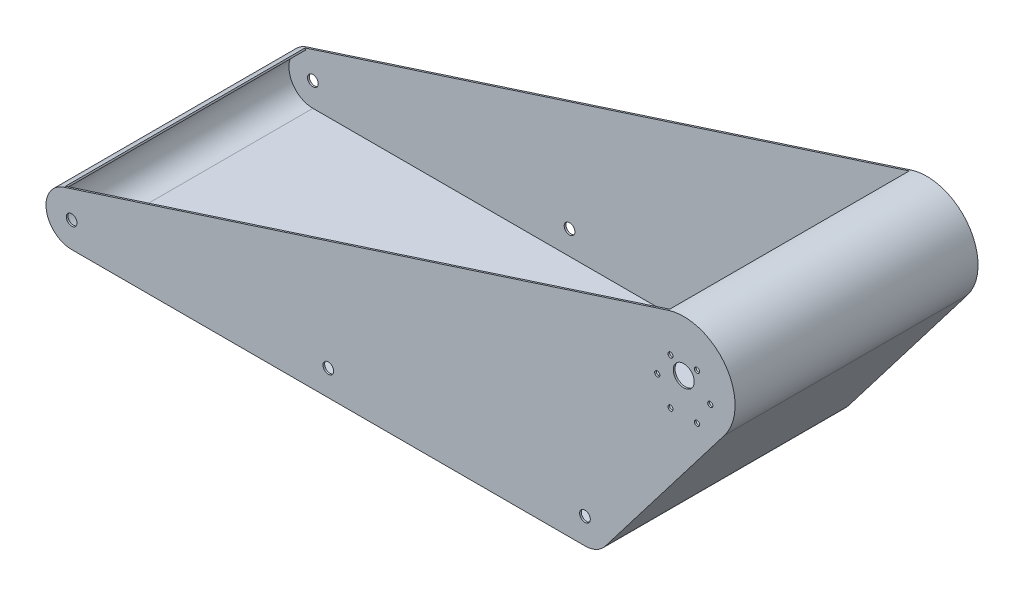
ISO-10303-21;
HEADER;
FILE_DESCRIPTION(('STEP AP214'),'2;1');
FILE_NAME('part.step','',(''),(''),'','','');
FILE_SCHEMA(('AUTOMOTIVE_DESIGN { 1 0 10303 214 1 1 1 1 }'));
ENDSEC;
DATA;
#1=APPLICATION_CONTEXT('core data for automotive mechanical design processes');
#2=APPLICATION_PROTOCOL_DEFINITION('international standard','automotive_design',2000,#1);
#3=PRODUCT_CONTEXT('',#1,'mechanical');
#4=PRODUCT('Part','Part','',(#3));
#5=PRODUCT_RELATED_PRODUCT_CATEGORY('part','',(#4));
#6=PRODUCT_DEFINITION_FORMATION('','',#4);
#7=PRODUCT_DEFINITION_CONTEXT('part definition',#1,'design');
#8=PRODUCT_DEFINITION('design','',#6,#7);
#9=PRODUCT_DEFINITION_SHAPE('','',#8);
#10=(LENGTH_UNIT() NAMED_UNIT(*) SI_UNIT(.MILLI.,.METRE.));
#11=(NAMED_UNIT(*) PLANE_ANGLE_UNIT() SI_UNIT($,.RADIAN.));
#12=(NAMED_UNIT(*) SI_UNIT($,.STERADIAN.) SOLID_ANGLE_UNIT());
#13=UNCERTAINTY_MEASURE_WITH_UNIT(LENGTH_MEASURE(1.E-05),#10,'distance_accuracy_value','');
#14=(GEOMETRIC_REPRESENTATION_CONTEXT(3) GLOBAL_UNCERTAINTY_ASSIGNED_CONTEXT((#13)) GLOBAL_UNIT_ASSIGNED_CONTEXT((#10,
#11,#12)) REPRESENTATION_CONTEXT('',''));
#15=CARTESIAN_POINT('',(0.,0.,0.));
#16=DIRECTION('',(0.,0.,1.));
#17=DIRECTION('',(1.,0.,0.));
#18=AXIS2_PLACEMENT_3D('',#15,#16,#17);
#19=CARTESIAN_POINT('',(0.,0.,1.));
#20=DIRECTION('',(0.,0.,-1.));
#21=DIRECTION('',(-1.,0.,0.));
#22=AXIS2_PLACEMENT_3D('',#19,#20,#21);
#23=CYLINDRICAL_SURFACE('',#22,15.);
#24=CARTESIAN_POINT('',(0.,0.,0.));
#25=DIRECTION('',(0.,0.,1.));
#26=DIRECTION('',(1.,0.,0.));
#27=AXIS2_PLACEMENT_3D('',#24,#25,#26);
#28=CIRCLE('',#27,15.);
#29=CARTESIAN_POINT('',(-4.61908911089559,14.2710902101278,0.));
#30=VERTEX_POINT('',#29);
#31=CARTESIAN_POINT('',(0.,-15.,0.));
#32=VERTEX_POINT('',#31);
#33=EDGE_CURVE('E232',#30,#32,#28,.T.);
#34=ORIENTED_EDGE('',*,*,#33,.T.);
#35=DIRECTION('',(0.,0.,-1.));
#36=VECTOR('',#35,1.);
#37=CARTESIAN_POINT('',(0.,-15.,1.));
#38=LINE('',#37,#36);
#39=CARTESIAN_POINT('',(0.,-15.,142.));
#40=VERTEX_POINT('',#39);
#41=EDGE_CURVE('E11',#40,#32,#38,.T.);
#42=ORIENTED_EDGE('',*,*,#41,.F.);
#43=CARTESIAN_POINT('',(0.,0.,142.));
#44=DIRECTION('',(0.,0.,1.));
#45=DIRECTION('',(1.,0.,0.));
#46=AXIS2_PLACEMENT_3D('',#43,#44,#45);
#47=CIRCLE('',#46,15.);
#48=CARTESIAN_POINT('',(-4.61908911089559,14.2710902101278,142.));
#49=VERTEX_POINT('',#48);
#50=EDGE_CURVE('E151',#49,#40,#47,.T.);
#51=ORIENTED_EDGE('',*,*,#50,.F.);
#52=DIRECTION('',(0.,0.,-1.));
#53=VECTOR('',#52,1.);
#54=CARTESIAN_POINT('',(-4.61908911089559,14.2710902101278,142.));
#55=LINE('',#54,#53);
#56=CARTESIAN_POINT('',(-4.61908911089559,14.2710902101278,141.));
#57=VERTEX_POINT('',#56);
#58=EDGE_CURVE('E147',#49,#57,#55,.T.);
#59=ORIENTED_EDGE('',*,*,#58,.T.);
#60=DIRECTION('',(0.,0.,-1.));
#61=VECTOR('',#60,1.);
#62=CARTESIAN_POINT('',(-4.61908911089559,14.2710902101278,141.));
#63=LINE('',#62,#61);
#64=CARTESIAN_POINT('',(-4.61908911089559,14.2710902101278,1.));
#65=VERTEX_POINT('',#64);
#66=EDGE_CURVE('E197',#57,#65,#63,.T.);
#67=ORIENTED_EDGE('',*,*,#66,.T.);
#68=DIRECTION('',(0.,0.,-1.));
#69=VECTOR('',#68,1.);
#70=CARTESIAN_POINT('',(-4.61908911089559,14.2710902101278,1.));
#71=LINE('',#70,#69);
#72=EDGE_CURVE('E235',#65,#30,#71,.T.);
#73=ORIENTED_EDGE('',*,*,#72,.T.);
#74=EDGE_LOOP('',(#34,#42,#51,#59,#67,#73));
#75=FACE_BOUND('',#74,.T.);
#76=ADVANCED_FACE('F42',(#75),#23,.T.);
#77=CARTESIAN_POINT('',(0.,-15.,1.));
#78=DIRECTION('',(0.,1.,0.));
#79=DIRECTION('',(0.,0.,1.));
#80=AXIS2_PLACEMENT_3D('',#77,#78,#79);
#81=PLANE('',#80);
#82=DIRECTION('',(1.,0.,0.));
#83=VECTOR('',#82,1.);
#84=CARTESIAN_POINT('',(0.,-15.,0.));
#85=LINE('',#84,#83);
#86=CARTESIAN_POINT('',(300.,-15.,0.));
#87=VERTEX_POINT('',#86);
#88=EDGE_CURVE('E239',#32,#87,#85,.T.);
#89=ORIENTED_EDGE('',*,*,#88,.T.);
#90=DIRECTION('',(0.,0.,-1.));
#91=VECTOR('',#90,1.);
#92=CARTESIAN_POINT('',(300.,-15.,1.));
#93=LINE('',#92,#91);
#94=CARTESIAN_POINT('',(300.,-15.,142.));
#95=VERTEX_POINT('',#94);
#96=EDGE_CURVE('E49',#95,#87,#93,.T.);
#97=ORIENTED_EDGE('',*,*,#96,.F.);
#98=DIRECTION('',(1.,0.,0.));
#99=VECTOR('',#98,1.);
#100=CARTESIAN_POINT('',(0.,-15.,142.));
#101=LINE('',#100,#99);
#102=EDGE_CURVE('E310',#40,#95,#101,.T.);
#103=ORIENTED_EDGE('',*,*,#102,.F.);
#104=ORIENTED_EDGE('',*,*,#41,.T.);
#105=EDGE_LOOP('',(#89,#97,#103,#104));
#106=FACE_BOUND('',#105,.T.);
#107=ADVANCED_FACE('F473',(#106),#81,.F.);
#108=CARTESIAN_POINT('',(300.,0.,1.));
#109=DIRECTION('',(0.,0.,-1.));
#110=DIRECTION('',(-1.,0.,0.));
#111=AXIS2_PLACEMENT_3D('',#108,#109,#110);
#112=CYLINDRICAL_SURFACE('',#111,15.);
#113=CARTESIAN_POINT('',(300.,0.,0.));
#114=DIRECTION('',(0.,0.,1.));
#115=DIRECTION('',(1.,0.,0.));
#116=AXIS2_PLACEMENT_3D('',#113,#114,#115);
#117=CIRCLE('',#116,15.);
#118=CARTESIAN_POINT('',(311.906339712,-9.12354507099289,0.));
#119=VERTEX_POINT('',#118);
#120=EDGE_CURVE('E241',#87,#119,#117,.T.);
#121=ORIENTED_EDGE('',*,*,#120,.T.);
#122=DIRECTION('',(0.,0.,-1.));
#123=VECTOR('',#122,1.);
#124=CARTESIAN_POINT('',(311.906339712,-9.12354507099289,1.));
#125=LINE('',#124,#123);
#126=CARTESIAN_POINT('',(311.906339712,-9.12354507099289,142.));
#127=VERTEX_POINT('',#126);
#128=EDGE_CURVE('E255',#127,#119,#125,.T.);
#129=ORIENTED_EDGE('',*,*,#128,.F.);
#130=CARTESIAN_POINT('',(300.,0.,142.));
#131=DIRECTION('',(0.,0.,1.));
#132=DIRECTION('',(1.,0.,0.));
#133=AXIS2_PLACEMENT_3D('',#130,#131,#132);
#134=CIRCLE('',#133,15.);
#135=EDGE_CURVE('E262',#95,#127,#134,.T.);
#136=ORIENTED_EDGE('',*,*,#135,.F.);
#137=ORIENTED_EDGE('',*,*,#96,.T.);
#138=EDGE_LOOP('',(#121,#129,#136,#137));
#139=FACE_BOUND('',#138,.T.);
#140=ADVANCED_FACE('F261',(#139),#112,.T.);
#141=CARTESIAN_POINT('',(311.906339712,-9.12354507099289,1.));
#142=DIRECTION('',(-0.793755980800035,0.608236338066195,0.));
#143=DIRECTION('',(-0.608236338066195,-0.793755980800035,0.));
#144=AXIS2_PLACEMENT_3D('',#141,#142,#143);
#145=PLANE('',#144);
#146=DIRECTION('',(0.608236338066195,0.793755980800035,0.));
#147=VECTOR('',#146,1.);
#148=CARTESIAN_POINT('',(311.906339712,-9.12354507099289,0.));
#149=LINE('',#148,#147);
#150=CARTESIAN_POINT('',(381.562679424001,81.778843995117,0.));
#151=VERTEX_POINT('',#150);
#152=EDGE_CURVE('E243',#119,#151,#149,.T.);
#153=ORIENTED_EDGE('',*,*,#152,.T.);
#154=DIRECTION('',(0.,0.,-1.));
#155=VECTOR('',#154,1.);
#156=CARTESIAN_POINT('',(381.562679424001,81.778843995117,1.));
#157=LINE('',#156,#155);
#158=CARTESIAN_POINT('',(381.562679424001,81.778843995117,142.));
#159=VERTEX_POINT('',#158);
#160=EDGE_CURVE('E253',#159,#151,#157,.T.);
#161=ORIENTED_EDGE('',*,*,#160,.F.);
#162=DIRECTION('',(0.608236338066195,0.793755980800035,0.));
#163=VECTOR('',#162,1.);
#164=CARTESIAN_POINT('',(311.906339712,-9.12354507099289,142.));
#165=LINE('',#164,#163);
#166=EDGE_CURVE('E159',#127,#159,#165,.T.);
#167=ORIENTED_EDGE('',*,*,#166,.F.);
#168=ORIENTED_EDGE('',*,*,#128,.T.);
#169=EDGE_LOOP('',(#153,#161,#167,#168));
#170=FACE_BOUND('',#169,.T.);
#171=ADVANCED_FACE('F273',(#170),#145,.F.);
#172=CARTESIAN_POINT('',(357.75,100.025934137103,1.));
#173=DIRECTION('',(0.,0.,-1.));
#174=DIRECTION('',(-1.,0.,0.));
#175=AXIS2_PLACEMENT_3D('',#172,#173,#174);
#176=CYLINDRICAL_SURFACE('',#175,30.);
#177=CARTESIAN_POINT('',(357.75,100.025934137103,0.));
#178=DIRECTION('',(0.,0.,1.));
#179=DIRECTION('',(1.,0.,0.));
#180=AXIS2_PLACEMENT_3D('',#177,#178,#179);
#181=CIRCLE('',#180,30.);
#182=CARTESIAN_POINT('',(348.511821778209,128.568114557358,0.));
#183=VERTEX_POINT('',#182);
#184=EDGE_CURVE('E245',#151,#183,#181,.T.);
#185=ORIENTED_EDGE('',*,*,#184,.T.);
#186=DIRECTION('',(0.,0.,-1.));
#187=VECTOR('',#186,1.);
#188=CARTESIAN_POINT('',(348.511821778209,128.568114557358,1.));
#189=LINE('',#188,#187);
#190=CARTESIAN_POINT('',(348.511821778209,128.568114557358,1.));
#191=VERTEX_POINT('',#190);
#192=EDGE_CURVE('E250',#191,#183,#189,.T.);
#193=ORIENTED_EDGE('',*,*,#192,.F.);
#194=DIRECTION('',(0.,0.,-1.));
#195=VECTOR('',#194,1.);
#196=CARTESIAN_POINT('',(348.511821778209,128.568114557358,141.));
#197=LINE('',#196,#195);
#198=CARTESIAN_POINT('',(348.511821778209,128.568114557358,141.));
#199=VERTEX_POINT('',#198);
#200=EDGE_CURVE('E167',#199,#191,#197,.T.);
#201=ORIENTED_EDGE('',*,*,#200,.F.);
#202=DIRECTION('',(0.,0.,-1.));
#203=VECTOR('',#202,1.);
#204=CARTESIAN_POINT('',(348.511821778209,128.568114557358,142.));
#205=LINE('',#204,#203);
#206=CARTESIAN_POINT('',(348.511821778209,128.568114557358,142.));
#207=VERTEX_POINT('',#206);
#208=EDGE_CURVE('E145',#207,#199,#205,.T.);
#209=ORIENTED_EDGE('',*,*,#208,.F.);
#210=CARTESIAN_POINT('',(357.75,100.025934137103,142.));
#211=DIRECTION('',(0.,0.,1.));
#212=DIRECTION('',(1.,0.,0.));
#213=AXIS2_PLACEMENT_3D('',#210,#211,#212);
#214=CIRCLE('',#213,30.);
#215=EDGE_CURVE('E152',#159,#207,#214,.T.);
#216=ORIENTED_EDGE('',*,*,#215,.F.);
#217=ORIENTED_EDGE('',*,*,#160,.T.);
#218=EDGE_LOOP('',(#185,#193,#201,#209,#216,#217));
#219=FACE_BOUND('',#218,.T.);
#220=ADVANCED_FACE('F164',(#219),#176,.T.);
#221=CARTESIAN_POINT('',(348.511821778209,128.568114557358,1.));
#222=DIRECTION('',(0.307939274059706,-0.951406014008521,0.));
#223=DIRECTION('',(0.951406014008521,0.307939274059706,0.));
#224=AXIS2_PLACEMENT_3D('',#221,#222,#223);
#225=PLANE('',#224);
#226=DIRECTION('',(-0.951406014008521,-0.307939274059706,0.));
#227=VECTOR('',#226,1.);
#228=CARTESIAN_POINT('',(348.511821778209,128.568114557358,0.));
#229=LINE('',#228,#227);
#230=EDGE_CURVE('E236',#183,#30,#229,.T.);
#231=ORIENTED_EDGE('',*,*,#230,.T.);
#232=ORIENTED_EDGE('',*,*,#72,.F.);
#233=DIRECTION('',(-0.951406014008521,-0.307939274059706,0.));
#234=VECTOR('',#233,1.);
#235=CARTESIAN_POINT('',(348.511821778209,128.568114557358,1.));
#236=LINE('',#235,#234);
#237=EDGE_CURVE('E233',#191,#65,#236,.T.);
#238=ORIENTED_EDGE('',*,*,#237,.F.);
#239=ORIENTED_EDGE('',*,*,#192,.T.);
#240=EDGE_LOOP('',(#231,#232,#238,#239));
#241=FACE_BOUND('',#240,.T.);
#242=ADVANCED_FACE('F276',(#241),#225,.F.);
#243=CARTESIAN_POINT('',(0.,0.,1.));
#244=DIRECTION('',(0.,0.,1.));
#245=DIRECTION('',(1.,0.,0.));
#246=AXIS2_PLACEMENT_3D('',#243,#244,#245);
#247=PLANE('',#246);
#248=CARTESIAN_POINT('',(0.,0.,1.));
#249=DIRECTION('',(0.,0.,1.));
#250=DIRECTION('',(1.,0.,0.));
#251=AXIS2_PLACEMENT_3D('',#248,#249,#250);
#252=CIRCLE('',#251,3.125);
#253=CARTESIAN_POINT('',(3.125,0.,1.));
#254=VERTEX_POINT('',#253);
#255=EDGE_CURVE('E303',#254,#254,#252,.T.);
#256=ORIENTED_EDGE('',*,*,#255,.F.);
#257=EDGE_LOOP('',(#256));
#258=FACE_BOUND('',#257,.T.);
#259=CARTESIAN_POINT('',(350.,106.666802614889,1.));
#260=DIRECTION('',(0.,0.,1.));
#261=DIRECTION('',(1.,0.,0.));
#262=AXIS2_PLACEMENT_3D('',#259,#260,#261);
#263=CIRCLE('',#262,1.50000000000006);
#264=CARTESIAN_POINT('',(351.5,106.666802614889,1.));
#265=VERTEX_POINT('',#264);
#266=EDGE_CURVE('E315',#265,#265,#263,.T.);
#267=ORIENTED_EDGE('',*,*,#266,.F.);
#268=EDGE_LOOP('',(#267));
#269=FACE_BOUND('',#268,.T.);
#270=CARTESIAN_POINT('',(365.5,106.666802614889,1.));
#271=DIRECTION('',(0.,0.,1.));
#272=DIRECTION('',(1.,0.,0.));
#273=AXIS2_PLACEMENT_3D('',#270,#271,#272);
#274=CIRCLE('',#273,1.5);
#275=CARTESIAN_POINT('',(367.,106.666802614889,1.));
#276=VERTEX_POINT('',#275);
#277=EDGE_CURVE('E321',#276,#276,#274,.T.);
#278=ORIENTED_EDGE('',*,*,#277,.F.);
#279=EDGE_LOOP('',(#278));
#280=FACE_BOUND('',#279,.T.);
#281=CARTESIAN_POINT('',(150.,0.,1.));
#282=DIRECTION('',(0.,0.,1.));
#283=DIRECTION('',(1.,0.,0.));
#284=AXIS2_PLACEMENT_3D('',#281,#282,#283);
#285=CIRCLE('',#284,3.125);
#286=CARTESIAN_POINT('',(153.125,0.,1.));
#287=VERTEX_POINT('',#286);
#288=EDGE_CURVE('E327',#287,#287,#285,.T.);
#289=ORIENTED_EDGE('',*,*,#288,.F.);
#290=EDGE_LOOP('',(#289));
#291=FACE_BOUND('',#290,.T.);
#292=CARTESIAN_POINT('',(357.75,100.025934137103,1.));
#293=DIRECTION('',(0.,0.,1.));
#294=DIRECTION('',(1.,0.,0.));
#295=AXIS2_PLACEMENT_3D('',#292,#293,#294);
#296=CIRCLE('',#295,6.12499999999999);
#297=CARTESIAN_POINT('',(363.875,100.025934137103,1.));
#298=VERTEX_POINT('',#297);
#299=EDGE_CURVE('E333',#298,#298,#296,.T.);
#300=ORIENTED_EDGE('',*,*,#299,.F.);
#301=EDGE_LOOP('',(#300));
#302=FACE_BOUND('',#301,.T.);
#303=CARTESIAN_POINT('',(300.,0.,1.));
#304=DIRECTION('',(0.,0.,1.));
#305=DIRECTION('',(1.,0.,0.));
#306=AXIS2_PLACEMENT_3D('',#303,#304,#305);
#307=CIRCLE('',#306,3.125);
#308=CARTESIAN_POINT('',(303.125,0.,1.));
#309=VERTEX_POINT('',#308);
#310=EDGE_CURVE('E339',#309,#309,#307,.T.);
#311=ORIENTED_EDGE('',*,*,#310,.F.);
#312=EDGE_LOOP('',(#311));
#313=FACE_BOUND('',#312,.T.);
#314=CARTESIAN_POINT('',(373.25,93.2434088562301,1.));
#315=DIRECTION('',(0.,0.,1.));
#316=DIRECTION('',(1.,0.,0.));
#317=AXIS2_PLACEMENT_3D('',#314,#315,#316);
#318=CIRCLE('',#317,1.5);
#319=CARTESIAN_POINT('',(374.75,93.2434088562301,1.));
#320=VERTEX_POINT('',#319);
#321=EDGE_CURVE('E345',#320,#320,#318,.T.);
#322=ORIENTED_EDGE('',*,*,#321,.F.);
#323=EDGE_LOOP('',(#322));
#324=FACE_BOUND('',#323,.T.);
#325=CARTESIAN_POINT('',(365.5,79.8200150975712,1.));
#326=DIRECTION('',(0.,0.,1.));
#327=DIRECTION('',(1.,0.,0.));
#328=AXIS2_PLACEMENT_3D('',#325,#326,#327);
#329=CIRCLE('',#328,1.5);
#330=CARTESIAN_POINT('',(367.,79.8200150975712,1.));
#331=VERTEX_POINT('',#330);
#332=EDGE_CURVE('E351',#331,#331,#329,.T.);
#333=ORIENTED_EDGE('',*,*,#332,.F.);
#334=EDGE_LOOP('',(#333));
#335=FACE_BOUND('',#334,.T.);
#336=CARTESIAN_POINT('',(350.,79.8200150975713,1.));
#337=DIRECTION('',(0.,0.,1.));
#338=DIRECTION('',(1.,0.,0.));
#339=AXIS2_PLACEMENT_3D('',#336,#337,#338);
#340=CIRCLE('',#339,1.5);
#341=CARTESIAN_POINT('',(351.5,79.8200150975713,1.));
#342=VERTEX_POINT('',#341);
#343=EDGE_CURVE('E357',#342,#342,#340,.T.);
#344=ORIENTED_EDGE('',*,*,#343,.F.);
#345=EDGE_LOOP('',(#344));
#346=FACE_BOUND('',#345,.T.);
#347=CARTESIAN_POINT('',(342.25,93.2434088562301,1.));
#348=DIRECTION('',(0.,0.,1.));
#349=DIRECTION('',(1.,0.,0.));
#350=AXIS2_PLACEMENT_3D('',#347,#348,#349);
#351=CIRCLE('',#350,1.5);
#352=CARTESIAN_POINT('',(343.75,93.2434088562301,1.));
#353=VERTEX_POINT('',#352);
#354=EDGE_CURVE('E363',#353,#353,#351,.T.);
#355=ORIENTED_EDGE('',*,*,#354,.F.);
#356=EDGE_LOOP('',(#355));
#357=FACE_BOUND('',#356,.T.);
#358=DIRECTION('',(-0.307939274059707,0.95140601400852,0.));
#359=VECTOR('',#358,1.);
#360=CARTESIAN_POINT('',(-4.61908911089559,14.2710902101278,1.));
#361=LINE('',#360,#359);
#362=CARTESIAN_POINT('',(-4.31114983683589,13.3196841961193,1.));
#363=VERTEX_POINT('',#362);
#364=EDGE_CURVE('E56',#363,#65,#361,.T.);
#365=ORIENTED_EDGE('',*,*,#364,.F.);
#366=CARTESIAN_POINT('',(0.,0.,1.));
#367=DIRECTION('',(0.,0.,-1.));
#368=DIRECTION('',(1.,0.,0.));
#369=AXIS2_PLACEMENT_3D('',#366,#367,#368);
#370=CIRCLE('',#369,14.);
#371=CARTESIAN_POINT('',(0.,-14.,1.));
#372=VERTEX_POINT('',#371);
#373=EDGE_CURVE('E60',#372,#363,#370,.T.);
#374=ORIENTED_EDGE('',*,*,#373,.F.);
#375=DIRECTION('',(-1.,0.,0.));
#376=VECTOR('',#375,1.);
#377=CARTESIAN_POINT('',(0.,-14.,1.));
#378=LINE('',#377,#376);
#379=CARTESIAN_POINT('',(300.,-14.,1.));
#380=VERTEX_POINT('',#379);
#381=EDGE_CURVE('E207',#380,#372,#378,.T.);
#382=ORIENTED_EDGE('',*,*,#381,.F.);
#383=CARTESIAN_POINT('',(300.,0.,1.));
#384=DIRECTION('',(0.,0.,-1.));
#385=DIRECTION('',(1.,0.,0.));
#386=AXIS2_PLACEMENT_3D('',#383,#384,#385);
#387=CIRCLE('',#386,14.);
#388=CARTESIAN_POINT('',(311.1125837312,-8.51530873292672,1.));
#389=VERTEX_POINT('',#388);
#390=EDGE_CURVE('E204',#389,#380,#387,.T.);
#391=ORIENTED_EDGE('',*,*,#390,.F.);
#392=DIRECTION('',(-0.608236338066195,-0.793755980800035,0.));
#393=VECTOR('',#392,1.);
#394=CARTESIAN_POINT('',(311.1125837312,-8.51530873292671,1.));
#395=LINE('',#394,#393);
#396=CARTESIAN_POINT('',(380.768923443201,82.3870803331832,1.));
#397=VERTEX_POINT('',#396);
#398=EDGE_CURVE('E201',#397,#389,#395,.T.);
#399=ORIENTED_EDGE('',*,*,#398,.F.);
#400=CARTESIAN_POINT('',(357.75,100.025934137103,1.));
#401=DIRECTION('',(0.,0.,-1.));
#402=DIRECTION('',(1.,0.,0.));
#403=AXIS2_PLACEMENT_3D('',#400,#401,#402);
#404=CIRCLE('',#403,29.);
#405=CARTESIAN_POINT('',(348.819761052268,127.61670854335,1.));
#406=VERTEX_POINT('',#405);
#407=EDGE_CURVE('E172',#406,#397,#404,.T.);
#408=ORIENTED_EDGE('',*,*,#407,.F.);
#409=DIRECTION('',(0.307939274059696,-0.951406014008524,0.));
#410=VECTOR('',#409,1.);
#411=CARTESIAN_POINT('',(348.511821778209,128.568114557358,1.));
#412=LINE('',#411,#410);
#413=EDGE_CURVE('E169',#191,#406,#412,.T.);
#414=ORIENTED_EDGE('',*,*,#413,.F.);
#415=ORIENTED_EDGE('',*,*,#237,.T.);
#416=EDGE_LOOP('',(#365,#374,#382,#391,#399,#408,#414,#415));
#417=FACE_BOUND('',#416,.T.);
#418=ADVANCED_FACE('F288',(#258,#269,#280,#291,#302,#313,#324,#335,#346,#357,#417),#247,.T.);
#419=CARTESIAN_POINT('',(0.,0.,0.));
#420=DIRECTION('',(0.,0.,1.));
#421=DIRECTION('',(1.,0.,0.));
#422=AXIS2_PLACEMENT_3D('',#419,#420,#421);
#423=PLANE('',#422);
#424=CARTESIAN_POINT('',(0.,0.,0.));
#425=DIRECTION('',(0.,0.,1.));
#426=DIRECTION('',(1.,0.,0.));
#427=AXIS2_PLACEMENT_3D('',#424,#425,#426);
#428=CIRCLE('',#427,3.125);
#429=CARTESIAN_POINT('',(3.125,0.,0.));
#430=VERTEX_POINT('',#429);
#431=EDGE_CURVE('E369',#430,#430,#428,.F.);
#432=ORIENTED_EDGE('',*,*,#431,.F.);
#433=EDGE_LOOP('',(#432));
#434=FACE_BOUND('',#433,.T.);
#435=CARTESIAN_POINT('',(350.,106.666802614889,0.));
#436=DIRECTION('',(0.,0.,1.));
#437=DIRECTION('',(1.,0.,0.));
#438=AXIS2_PLACEMENT_3D('',#435,#436,#437);
#439=CIRCLE('',#438,1.50000000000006);
#440=CARTESIAN_POINT('',(351.5,106.666802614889,0.));
#441=VERTEX_POINT('',#440);
#442=EDGE_CURVE('E422',#441,#441,#439,.F.);
#443=ORIENTED_EDGE('',*,*,#442,.F.);
#444=EDGE_LOOP('',(#443));
#445=FACE_BOUND('',#444,.T.);
#446=CARTESIAN_POINT('',(365.5,106.666802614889,0.));
#447=DIRECTION('',(0.,0.,1.));
#448=DIRECTION('',(1.,0.,0.));
#449=AXIS2_PLACEMENT_3D('',#446,#447,#448);
#450=CIRCLE('',#449,1.5);
#451=CARTESIAN_POINT('',(367.,106.666802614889,0.));
#452=VERTEX_POINT('',#451);
#453=EDGE_CURVE('E388',#452,#452,#450,.F.);
#454=ORIENTED_EDGE('',*,*,#453,.F.);
#455=EDGE_LOOP('',(#454));
#456=FACE_BOUND('',#455,.T.);
#457=CARTESIAN_POINT('',(150.,0.,0.));
#458=DIRECTION('',(0.,0.,1.));
#459=DIRECTION('',(1.,0.,0.));
#460=AXIS2_PLACEMENT_3D('',#457,#458,#459);
#461=CIRCLE('',#460,3.125);
#462=CARTESIAN_POINT('',(153.125,0.,0.));
#463=VERTEX_POINT('',#462);
#464=EDGE_CURVE('E387',#463,#463,#461,.F.);
#465=ORIENTED_EDGE('',*,*,#464,.F.);
#466=EDGE_LOOP('',(#465));
#467=FACE_BOUND('',#466,.T.);
#468=CARTESIAN_POINT('',(357.75,100.025934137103,0.));
#469=DIRECTION('',(0.,0.,1.));
#470=DIRECTION('',(1.,0.,0.));
#471=AXIS2_PLACEMENT_3D('',#468,#469,#470);
#472=CIRCLE('',#471,6.12499999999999);
#473=CARTESIAN_POINT('',(363.875,100.025934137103,0.));
#474=VERTEX_POINT('',#473);
#475=EDGE_CURVE('E374',#474,#474,#472,.F.);
#476=ORIENTED_EDGE('',*,*,#475,.F.);
#477=EDGE_LOOP('',(#476));
#478=FACE_BOUND('',#477,.T.);
#479=CARTESIAN_POINT('',(300.,0.,0.));
#480=DIRECTION('',(0.,0.,1.));
#481=DIRECTION('',(1.,0.,0.));
#482=AXIS2_PLACEMENT_3D('',#479,#480,#481);
#483=CIRCLE('',#482,3.125);
#484=CARTESIAN_POINT('',(303.125,0.,0.));
#485=VERTEX_POINT('',#484);
#486=EDGE_CURVE('E373',#485,#485,#483,.F.);
#487=ORIENTED_EDGE('',*,*,#486,.F.);
#488=EDGE_LOOP('',(#487));
#489=FACE_BOUND('',#488,.T.);
#490=CARTESIAN_POINT('',(373.25,93.2434088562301,0.));
#491=DIRECTION('',(0.,0.,1.));
#492=DIRECTION('',(1.,0.,0.));
#493=AXIS2_PLACEMENT_3D('',#490,#491,#492);
#494=CIRCLE('',#493,1.5);
#495=CARTESIAN_POINT('',(374.75,93.2434088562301,0.));
#496=VERTEX_POINT('',#495);
#497=EDGE_CURVE('E413',#496,#496,#494,.F.);
#498=ORIENTED_EDGE('',*,*,#497,.F.);
#499=EDGE_LOOP('',(#498));
#500=FACE_BOUND('',#499,.T.);
#501=CARTESIAN_POINT('',(365.5,79.8200150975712,0.));
#502=DIRECTION('',(0.,0.,1.));
#503=DIRECTION('',(1.,0.,0.));
#504=AXIS2_PLACEMENT_3D('',#501,#502,#503);
#505=CIRCLE('',#504,1.5);
#506=CARTESIAN_POINT('',(367.,79.8200150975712,0.));
#507=VERTEX_POINT('',#506);
#508=EDGE_CURVE('E407',#507,#507,#505,.F.);
#509=ORIENTED_EDGE('',*,*,#508,.F.);
#510=EDGE_LOOP('',(#509));
#511=FACE_BOUND('',#510,.T.);
#512=CARTESIAN_POINT('',(350.,79.8200150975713,0.));
#513=DIRECTION('',(0.,0.,1.));
#514=DIRECTION('',(1.,0.,0.));
#515=AXIS2_PLACEMENT_3D('',#512,#513,#514);
#516=CIRCLE('',#515,1.5);
#517=CARTESIAN_POINT('',(351.5,79.8200150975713,0.));
#518=VERTEX_POINT('',#517);
#519=EDGE_CURVE('E399',#518,#518,#516,.F.);
#520=ORIENTED_EDGE('',*,*,#519,.F.);
#521=EDGE_LOOP('',(#520));
#522=FACE_BOUND('',#521,.T.);
#523=CARTESIAN_POINT('',(342.25,93.2434088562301,0.));
#524=DIRECTION('',(0.,0.,1.));
#525=DIRECTION('',(1.,0.,0.));
#526=AXIS2_PLACEMENT_3D('',#523,#524,#525);
#527=CIRCLE('',#526,1.5);
#528=CARTESIAN_POINT('',(343.75,93.2434088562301,0.));
#529=VERTEX_POINT('',#528);
#530=EDGE_CURVE('E400',#529,#529,#527,.F.);
#531=ORIENTED_EDGE('',*,*,#530,.F.);
#532=EDGE_LOOP('',(#531));
#533=FACE_BOUND('',#532,.T.);
#534=ORIENTED_EDGE('',*,*,#33,.F.);
#535=ORIENTED_EDGE('',*,*,#230,.F.);
#536=ORIENTED_EDGE('',*,*,#184,.F.);
#537=ORIENTED_EDGE('',*,*,#152,.F.);
#538=ORIENTED_EDGE('',*,*,#120,.F.);
#539=ORIENTED_EDGE('',*,*,#88,.F.);
#540=EDGE_LOOP('',(#534,#535,#536,#537,#538,#539));
#541=FACE_BOUND('',#540,.T.);
#542=ADVANCED_FACE('F269',(#434,#445,#456,#467,#478,#489,#500,#511,#522,#533,#541),#423,.F.);
#543=CARTESIAN_POINT('',(348.511821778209,128.568114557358,141.));
#544=DIRECTION('',(0.951406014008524,0.307939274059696,0.));
#545=DIRECTION('',(-0.307939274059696,0.951406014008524,0.));
#546=AXIS2_PLACEMENT_3D('',#543,#544,#545);
#547=PLANE('',#546);
#548=ORIENTED_EDGE('',*,*,#413,.T.);
#549=DIRECTION('',(0.,0.,-1.));
#550=VECTOR('',#549,1.);
#551=CARTESIAN_POINT('',(348.819761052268,127.61670854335,141.));
#552=LINE('',#551,#550);
#553=CARTESIAN_POINT('',(348.819761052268,127.61670854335,141.));
#554=VERTEX_POINT('',#553);
#555=EDGE_CURVE('E228',#554,#406,#552,.T.);
#556=ORIENTED_EDGE('',*,*,#555,.F.);
#557=DIRECTION('',(0.307939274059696,-0.951406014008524,0.));
#558=VECTOR('',#557,1.);
#559=CARTESIAN_POINT('',(348.511821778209,128.568114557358,141.));
#560=LINE('',#559,#558);
#561=EDGE_CURVE('E177',#199,#554,#560,.T.);
#562=ORIENTED_EDGE('',*,*,#561,.F.);
#563=ORIENTED_EDGE('',*,*,#200,.T.);
#564=EDGE_LOOP('',(#548,#556,#562,#563));
#565=FACE_BOUND('',#564,.T.);
#566=ADVANCED_FACE('F299',(#565),#547,.F.);
#567=CARTESIAN_POINT('',(357.75,100.025934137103,141.));
#568=DIRECTION('',(0.,0.,-1.));
#569=DIRECTION('',(-1.,0.,0.));
#570=AXIS2_PLACEMENT_3D('',#567,#568,#569);
#571=CYLINDRICAL_SURFACE('',#570,29.);
#572=ORIENTED_EDGE('',*,*,#407,.T.);
#573=DIRECTION('',(0.,0.,-1.));
#574=VECTOR('',#573,1.);
#575=CARTESIAN_POINT('',(380.768923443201,82.3870803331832,141.));
#576=LINE('',#575,#574);
#577=CARTESIAN_POINT('',(380.768923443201,82.3870803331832,141.));
#578=VERTEX_POINT('',#577);
#579=EDGE_CURVE('E225',#578,#397,#576,.T.);
#580=ORIENTED_EDGE('',*,*,#579,.F.);
#581=CARTESIAN_POINT('',(357.75,100.025934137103,141.));
#582=DIRECTION('',(0.,0.,-1.));
#583=DIRECTION('',(1.,0.,0.));
#584=AXIS2_PLACEMENT_3D('',#581,#582,#583);
#585=CIRCLE('',#584,29.);
#586=EDGE_CURVE('E180',#554,#578,#585,.T.);
#587=ORIENTED_EDGE('',*,*,#586,.F.);
#588=ORIENTED_EDGE('',*,*,#555,.T.);
#589=EDGE_LOOP('',(#572,#580,#587,#588));
#590=FACE_BOUND('',#589,.T.);
#591=ADVANCED_FACE('F296',(#590),#571,.F.);
#592=CARTESIAN_POINT('',(311.1125837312,-8.51530873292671,141.));
#593=DIRECTION('',(0.793755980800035,-0.608236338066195,0.));
#594=DIRECTION('',(0.608236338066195,0.793755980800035,0.));
#595=AXIS2_PLACEMENT_3D('',#592,#593,#594);
#596=PLANE('',#595);
#597=ORIENTED_EDGE('',*,*,#398,.T.);
#598=DIRECTION('',(0.,0.,-1.));
#599=VECTOR('',#598,1.);
#600=CARTESIAN_POINT('',(311.1125837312,-8.51530873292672,141.));
#601=LINE('',#600,#599);
#602=CARTESIAN_POINT('',(311.1125837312,-8.51530873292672,141.));
#603=VERTEX_POINT('',#602);
#604=EDGE_CURVE('E222',#603,#389,#601,.T.);
#605=ORIENTED_EDGE('',*,*,#604,.F.);
#606=DIRECTION('',(-0.608236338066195,-0.793755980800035,0.));
#607=VECTOR('',#606,1.);
#608=CARTESIAN_POINT('',(311.1125837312,-8.51530873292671,141.));
#609=LINE('',#608,#607);
#610=EDGE_CURVE('E183',#578,#603,#609,.T.);
#611=ORIENTED_EDGE('',*,*,#610,.F.);
#612=ORIENTED_EDGE('',*,*,#579,.T.);
#613=EDGE_LOOP('',(#597,#605,#611,#612));
#614=FACE_BOUND('',#613,.T.);
#615=ADVANCED_FACE('F294',(#614),#596,.F.);
#616=CARTESIAN_POINT('',(300.,0.,141.));
#617=DIRECTION('',(0.,0.,-1.));
#618=DIRECTION('',(-1.,0.,0.));
#619=AXIS2_PLACEMENT_3D('',#616,#617,#618);
#620=CYLINDRICAL_SURFACE('',#619,14.);
#621=ORIENTED_EDGE('',*,*,#390,.T.);
#622=DIRECTION('',(0.,0.,-1.));
#623=VECTOR('',#622,1.);
#624=CARTESIAN_POINT('',(300.,-14.,141.));
#625=LINE('',#624,#623);
#626=CARTESIAN_POINT('',(300.,-14.,141.));
#627=VERTEX_POINT('',#626);
#628=EDGE_CURVE('E219',#627,#380,#625,.T.);
#629=ORIENTED_EDGE('',*,*,#628,.F.);
#630=CARTESIAN_POINT('',(300.,0.,141.));
#631=DIRECTION('',(0.,0.,-1.));
#632=DIRECTION('',(1.,0.,0.));
#633=AXIS2_PLACEMENT_3D('',#630,#631,#632);
#634=CIRCLE('',#633,14.);
#635=EDGE_CURVE('E186',#603,#627,#634,.T.);
#636=ORIENTED_EDGE('',*,*,#635,.F.);
#637=ORIENTED_EDGE('',*,*,#604,.T.);
#638=EDGE_LOOP('',(#621,#629,#636,#637));
#639=FACE_BOUND('',#638,.T.);
#640=ADVANCED_FACE('F290',(#639),#620,.F.);
#641=CARTESIAN_POINT('',(0.,-14.,141.));
#642=DIRECTION('',(0.,-1.,0.));
#643=DIRECTION('',(1.,0.,0.));
#644=AXIS2_PLACEMENT_3D('',#641,#642,#643);
#645=PLANE('',#644);
#646=ORIENTED_EDGE('',*,*,#381,.T.);
#647=DIRECTION('',(0.,0.,-1.));
#648=VECTOR('',#647,1.);
#649=CARTESIAN_POINT('',(0.,-14.,141.));
#650=LINE('',#649,#648);
#651=CARTESIAN_POINT('',(0.,-14.,141.));
#652=VERTEX_POINT('',#651);
#653=EDGE_CURVE('E216',#652,#372,#650,.T.);
#654=ORIENTED_EDGE('',*,*,#653,.F.);
#655=DIRECTION('',(-1.,0.,0.));
#656=VECTOR('',#655,1.);
#657=CARTESIAN_POINT('',(0.,-14.,141.));
#658=LINE('',#657,#656);
#659=EDGE_CURVE('E189',#627,#652,#658,.T.);
#660=ORIENTED_EDGE('',*,*,#659,.F.);
#661=ORIENTED_EDGE('',*,*,#628,.T.);
#662=EDGE_LOOP('',(#646,#654,#660,#661));
#663=FACE_BOUND('',#662,.T.);
#664=ADVANCED_FACE('F287',(#663),#645,.F.);
#665=CARTESIAN_POINT('',(0.,0.,141.));
#666=DIRECTION('',(0.,0.,-1.));
#667=DIRECTION('',(-1.,0.,0.));
#668=AXIS2_PLACEMENT_3D('',#665,#666,#667);
#669=CYLINDRICAL_SURFACE('',#668,14.);
#670=ORIENTED_EDGE('',*,*,#373,.T.);
#671=DIRECTION('',(0.,0.,-1.));
#672=VECTOR('',#671,1.);
#673=CARTESIAN_POINT('',(-4.31114983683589,13.3196841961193,141.));
#674=LINE('',#673,#672);
#675=CARTESIAN_POINT('',(-4.31114983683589,13.3196841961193,141.));
#676=VERTEX_POINT('',#675);
#677=EDGE_CURVE('E213',#676,#363,#674,.T.);
#678=ORIENTED_EDGE('',*,*,#677,.F.);
#679=CARTESIAN_POINT('',(0.,0.,141.));
#680=DIRECTION('',(0.,0.,-1.));
#681=DIRECTION('',(1.,0.,0.));
#682=AXIS2_PLACEMENT_3D('',#679,#680,#681);
#683=CIRCLE('',#682,14.);
#684=EDGE_CURVE('E192',#652,#676,#683,.T.);
#685=ORIENTED_EDGE('',*,*,#684,.F.);
#686=ORIENTED_EDGE('',*,*,#653,.T.);
#687=EDGE_LOOP('',(#670,#678,#685,#686));
#688=FACE_BOUND('',#687,.T.);
#689=ADVANCED_FACE('F284',(#688),#669,.F.);
#690=CARTESIAN_POINT('',(-4.61908911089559,14.2710902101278,141.));
#691=DIRECTION('',(-0.95140601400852,-0.307939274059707,0.));
#692=DIRECTION('',(0.307939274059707,-0.951406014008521,0.));
#693=AXIS2_PLACEMENT_3D('',#690,#691,#692);
#694=PLANE('',#693);
#695=ORIENTED_EDGE('',*,*,#364,.T.);
#696=ORIENTED_EDGE('',*,*,#66,.F.);
#697=DIRECTION('',(-0.307939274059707,0.95140601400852,0.));
#698=VECTOR('',#697,1.);
#699=CARTESIAN_POINT('',(-4.61908911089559,14.2710902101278,141.));
#700=LINE('',#699,#698);
#701=EDGE_CURVE('E195',#676,#57,#700,.T.);
#702=ORIENTED_EDGE('',*,*,#701,.F.);
#703=ORIENTED_EDGE('',*,*,#677,.T.);
#704=EDGE_LOOP('',(#695,#696,#702,#703));
#705=FACE_BOUND('',#704,.T.);
#706=ADVANCED_FACE('F280',(#705),#694,.F.);
#707=CARTESIAN_POINT('',(357.75,100.025934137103,141.));
#708=DIRECTION('',(0.,0.,1.));
#709=DIRECTION('',(1.,0.,0.));
#710=AXIS2_PLACEMENT_3D('',#707,#708,#709);
#711=PLANE('',#710);
#712=CARTESIAN_POINT('',(0.,0.,141.));
#713=DIRECTION('',(0.,0.,1.));
#714=DIRECTION('',(1.,0.,0.));
#715=AXIS2_PLACEMENT_3D('',#712,#713,#714);
#716=CIRCLE('',#715,3.125);
#717=CARTESIAN_POINT('',(3.125,0.,141.));
#718=VERTEX_POINT('',#717);
#719=EDGE_CURVE('E305',#718,#718,#716,.T.);
#720=ORIENTED_EDGE('',*,*,#719,.T.);
#721=EDGE_LOOP('',(#720));
#722=FACE_BOUND('',#721,.T.);
#723=CARTESIAN_POINT('',(350.,106.666802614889,141.));
#724=DIRECTION('',(0.,0.,1.));
#725=DIRECTION('',(1.,0.,0.));
#726=AXIS2_PLACEMENT_3D('',#723,#724,#725);
#727=CIRCLE('',#726,1.50000000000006);
#728=CARTESIAN_POINT('',(351.5,106.666802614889,141.));
#729=VERTEX_POINT('',#728);
#730=EDGE_CURVE('E318',#729,#729,#727,.T.);
#731=ORIENTED_EDGE('',*,*,#730,.T.);
#732=EDGE_LOOP('',(#731));
#733=FACE_BOUND('',#732,.T.);
#734=CARTESIAN_POINT('',(365.5,106.666802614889,141.));
#735=DIRECTION('',(0.,0.,1.));
#736=DIRECTION('',(1.,0.,0.));
#737=AXIS2_PLACEMENT_3D('',#734,#735,#736);
#738=CIRCLE('',#737,1.5);
#739=CARTESIAN_POINT('',(367.,106.666802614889,141.));
#740=VERTEX_POINT('',#739);
#741=EDGE_CURVE('E324',#740,#740,#738,.T.);
#742=ORIENTED_EDGE('',*,*,#741,.T.);
#743=EDGE_LOOP('',(#742));
#744=FACE_BOUND('',#743,.T.);
#745=CARTESIAN_POINT('',(150.,0.,141.));
#746=DIRECTION('',(0.,0.,1.));
#747=DIRECTION('',(1.,0.,0.));
#748=AXIS2_PLACEMENT_3D('',#745,#746,#747);
#749=CIRCLE('',#748,3.125);
#750=CARTESIAN_POINT('',(153.125,0.,141.));
#751=VERTEX_POINT('',#750);
#752=EDGE_CURVE('E330',#751,#751,#749,.T.);
#753=ORIENTED_EDGE('',*,*,#752,.T.);
#754=EDGE_LOOP('',(#753));
#755=FACE_BOUND('',#754,.T.);
#756=CARTESIAN_POINT('',(357.75,100.025934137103,141.));
#757=DIRECTION('',(0.,0.,1.));
#758=DIRECTION('',(1.,0.,0.));
#759=AXIS2_PLACEMENT_3D('',#756,#757,#758);
#760=CIRCLE('',#759,6.12499999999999);
#761=CARTESIAN_POINT('',(363.875,100.025934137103,141.));
#762=VERTEX_POINT('',#761);
#763=EDGE_CURVE('E336',#762,#762,#760,.T.);
#764=ORIENTED_EDGE('',*,*,#763,.T.);
#765=EDGE_LOOP('',(#764));
#766=FACE_BOUND('',#765,.T.);
#767=CARTESIAN_POINT('',(300.,0.,141.));
#768=DIRECTION('',(0.,0.,1.));
#769=DIRECTION('',(1.,0.,0.));
#770=AXIS2_PLACEMENT_3D('',#767,#768,#769);
#771=CIRCLE('',#770,3.125);
#772=CARTESIAN_POINT('',(303.125,0.,141.));
#773=VERTEX_POINT('',#772);
#774=EDGE_CURVE('E342',#773,#773,#771,.T.);
#775=ORIENTED_EDGE('',*,*,#774,.T.);
#776=EDGE_LOOP('',(#775));
#777=FACE_BOUND('',#776,.T.);
#778=CARTESIAN_POINT('',(373.25,93.2434088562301,141.));
#779=DIRECTION('',(0.,0.,1.));
#780=DIRECTION('',(1.,0.,0.));
#781=AXIS2_PLACEMENT_3D('',#778,#779,#780);
#782=CIRCLE('',#781,1.5);
#783=CARTESIAN_POINT('',(374.75,93.2434088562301,141.));
#784=VERTEX_POINT('',#783);
#785=EDGE_CURVE('E348',#784,#784,#782,.T.);
#786=ORIENTED_EDGE('',*,*,#785,.T.);
#787=EDGE_LOOP('',(#786));
#788=FACE_BOUND('',#787,.T.);
#789=CARTESIAN_POINT('',(365.5,79.8200150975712,141.));
#790=DIRECTION('',(0.,0.,1.));
#791=DIRECTION('',(1.,0.,0.));
#792=AXIS2_PLACEMENT_3D('',#789,#790,#791);
#793=CIRCLE('',#792,1.5);
#794=CARTESIAN_POINT('',(367.,79.8200150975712,141.));
#795=VERTEX_POINT('',#794);
#796=EDGE_CURVE('E354',#795,#795,#793,.T.);
#797=ORIENTED_EDGE('',*,*,#796,.T.);
#798=EDGE_LOOP('',(#797));
#799=FACE_BOUND('',#798,.T.);
#800=CARTESIAN_POINT('',(350.,79.8200150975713,141.));
#801=DIRECTION('',(0.,0.,1.));
#802=DIRECTION('',(1.,0.,0.));
#803=AXIS2_PLACEMENT_3D('',#800,#801,#802);
#804=CIRCLE('',#803,1.5);
#805=CARTESIAN_POINT('',(351.5,79.8200150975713,141.));
#806=VERTEX_POINT('',#805);
#807=EDGE_CURVE('E360',#806,#806,#804,.T.);
#808=ORIENTED_EDGE('',*,*,#807,.T.);
#809=EDGE_LOOP('',(#808));
#810=FACE_BOUND('',#809,.T.);
#811=CARTESIAN_POINT('',(342.25,93.2434088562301,141.));
#812=DIRECTION('',(0.,0.,1.));
#813=DIRECTION('',(1.,0.,0.));
#814=AXIS2_PLACEMENT_3D('',#811,#812,#813);
#815=CIRCLE('',#814,1.5);
#816=CARTESIAN_POINT('',(343.75,93.2434088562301,141.));
#817=VERTEX_POINT('',#816);
#818=EDGE_CURVE('E366',#817,#817,#815,.T.);
#819=ORIENTED_EDGE('',*,*,#818,.T.);
#820=EDGE_LOOP('',(#819));
#821=FACE_BOUND('',#820,.T.);
#822=DIRECTION('',(-0.951406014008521,-0.307939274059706,0.));
#823=VECTOR('',#822,1.);
#824=CARTESIAN_POINT('',(-4.61908911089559,14.2710902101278,141.));
#825=LINE('',#824,#823);
#826=EDGE_CURVE('E162',#199,#57,#825,.T.);
#827=ORIENTED_EDGE('',*,*,#826,.F.);
#828=ORIENTED_EDGE('',*,*,#561,.T.);
#829=ORIENTED_EDGE('',*,*,#586,.T.);
#830=ORIENTED_EDGE('',*,*,#610,.T.);
#831=ORIENTED_EDGE('',*,*,#635,.T.);
#832=ORIENTED_EDGE('',*,*,#659,.T.);
#833=ORIENTED_EDGE('',*,*,#684,.T.);
#834=ORIENTED_EDGE('',*,*,#701,.T.);
#835=EDGE_LOOP('',(#827,#828,#829,#830,#831,#832,#833,#834));
#836=FACE_BOUND('',#835,.T.);
#837=ADVANCED_FACE('F302',(#722,#733,#744,#755,#766,#777,#788,#799,#810,#821,#836),#711,.F.);
#838=CARTESIAN_POINT('',(-4.61908911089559,14.2710902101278,142.));
#839=DIRECTION('',(0.307939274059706,-0.951406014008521,0.));
#840=DIRECTION('',(0.951406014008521,0.307939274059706,0.));
#841=AXIS2_PLACEMENT_3D('',#838,#839,#840);
#842=PLANE('',#841);
#843=ORIENTED_EDGE('',*,*,#826,.T.);
#844=ORIENTED_EDGE('',*,*,#58,.F.);
#845=DIRECTION('',(-0.951406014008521,-0.307939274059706,0.));
#846=VECTOR('',#845,1.);
#847=CARTESIAN_POINT('',(-4.61908911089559,14.2710902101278,142.));
#848=LINE('',#847,#846);
#849=EDGE_CURVE('E140',#207,#49,#848,.T.);
#850=ORIENTED_EDGE('',*,*,#849,.F.);
#851=ORIENTED_EDGE('',*,*,#208,.T.);
#852=EDGE_LOOP('',(#843,#844,#850,#851));
#853=FACE_BOUND('',#852,.T.);
#854=ADVANCED_FACE('F143',(#853),#842,.F.);
#855=CARTESIAN_POINT('',(357.75,100.025934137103,142.));
#856=DIRECTION('',(0.,0.,1.));
#857=DIRECTION('',(1.,0.,0.));
#858=AXIS2_PLACEMENT_3D('',#855,#856,#857);
#859=PLANE('',#858);
#860=CARTESIAN_POINT('',(0.,0.,142.));
#861=DIRECTION('',(0.,0.,1.));
#862=DIRECTION('',(1.,0.,0.));
#863=AXIS2_PLACEMENT_3D('',#860,#861,#862);
#864=CIRCLE('',#863,3.125);
#865=CARTESIAN_POINT('',(3.125,0.,142.));
#866=VERTEX_POINT('',#865);
#867=EDGE_CURVE('E381',#866,#866,#864,.T.);
#868=ORIENTED_EDGE('',*,*,#867,.F.);
#869=EDGE_LOOP('',(#868));
#870=FACE_BOUND('',#869,.T.);
#871=CARTESIAN_POINT('',(350.,106.666802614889,142.));
#872=DIRECTION('',(0.,0.,1.));
#873=DIRECTION('',(1.,0.,0.));
#874=AXIS2_PLACEMENT_3D('',#871,#872,#873);
#875=CIRCLE('',#874,1.50000000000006);
#876=CARTESIAN_POINT('',(351.5,106.666802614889,142.));
#877=VERTEX_POINT('',#876);
#878=EDGE_CURVE('E403',#877,#877,#875,.T.);
#879=ORIENTED_EDGE('',*,*,#878,.F.);
#880=EDGE_LOOP('',(#879));
#881=FACE_BOUND('',#880,.T.);
#882=CARTESIAN_POINT('',(365.5,106.666802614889,142.));
#883=DIRECTION('',(0.,0.,1.));
#884=DIRECTION('',(1.,0.,0.));
#885=AXIS2_PLACEMENT_3D('',#882,#883,#884);
#886=CIRCLE('',#885,1.5);
#887=CARTESIAN_POINT('',(367.,106.666802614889,142.));
#888=VERTEX_POINT('',#887);
#889=EDGE_CURVE('E384',#888,#888,#886,.T.);
#890=ORIENTED_EDGE('',*,*,#889,.F.);
#891=EDGE_LOOP('',(#890));
#892=FACE_BOUND('',#891,.T.);
#893=CARTESIAN_POINT('',(150.,0.,142.));
#894=DIRECTION('',(0.,0.,1.));
#895=DIRECTION('',(1.,0.,0.));
#896=AXIS2_PLACEMENT_3D('',#893,#894,#895);
#897=CIRCLE('',#896,3.125);
#898=CARTESIAN_POINT('',(153.125,0.,142.));
#899=VERTEX_POINT('',#898);
#900=EDGE_CURVE('E377',#899,#899,#897,.T.);
#901=ORIENTED_EDGE('',*,*,#900,.F.);
#902=EDGE_LOOP('',(#901));
#903=FACE_BOUND('',#902,.T.);
#904=CARTESIAN_POINT('',(357.75,100.025934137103,142.));
#905=DIRECTION('',(0.,0.,1.));
#906=DIRECTION('',(1.,0.,0.));
#907=AXIS2_PLACEMENT_3D('',#904,#905,#906);
#908=CIRCLE('',#907,6.12499999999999);
#909=CARTESIAN_POINT('',(363.875,100.025934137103,142.));
#910=VERTEX_POINT('',#909);
#911=EDGE_CURVE('E370',#910,#910,#908,.T.);
#912=ORIENTED_EDGE('',*,*,#911,.F.);
#913=EDGE_LOOP('',(#912));
#914=FACE_BOUND('',#913,.T.);
#915=CARTESIAN_POINT('',(300.,0.,142.));
#916=DIRECTION('',(0.,0.,1.));
#917=DIRECTION('',(1.,0.,0.));
#918=AXIS2_PLACEMENT_3D('',#915,#916,#917);
#919=CIRCLE('',#918,3.125);
#920=CARTESIAN_POINT('',(303.125,0.,142.));
#921=VERTEX_POINT('',#920);
#922=EDGE_CURVE('E378',#921,#921,#919,.T.);
#923=ORIENTED_EDGE('',*,*,#922,.F.);
#924=EDGE_LOOP('',(#923));
#925=FACE_BOUND('',#924,.T.);
#926=CARTESIAN_POINT('',(373.25,93.2434088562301,142.));
#927=DIRECTION('',(0.,0.,1.));
#928=DIRECTION('',(1.,0.,0.));
#929=AXIS2_PLACEMENT_3D('',#926,#927,#928);
#930=CIRCLE('',#929,1.5);
#931=CARTESIAN_POINT('',(374.75,93.2434088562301,142.));
#932=VERTEX_POINT('',#931);
#933=EDGE_CURVE('E391',#932,#932,#930,.T.);
#934=ORIENTED_EDGE('',*,*,#933,.F.);
#935=EDGE_LOOP('',(#934));
#936=FACE_BOUND('',#935,.T.);
#937=CARTESIAN_POINT('',(365.5,79.8200150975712,142.));
#938=DIRECTION('',(0.,0.,1.));
#939=DIRECTION('',(1.,0.,0.));
#940=AXIS2_PLACEMENT_3D('',#937,#938,#939);
#941=CIRCLE('',#940,1.5);
#942=CARTESIAN_POINT('',(367.,79.8200150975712,142.));
#943=VERTEX_POINT('',#942);
#944=EDGE_CURVE('E410',#943,#943,#941,.T.);
#945=ORIENTED_EDGE('',*,*,#944,.F.);
#946=EDGE_LOOP('',(#945));
#947=FACE_BOUND('',#946,.T.);
#948=CARTESIAN_POINT('',(350.,79.8200150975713,142.));
#949=DIRECTION('',(0.,0.,1.));
#950=DIRECTION('',(1.,0.,0.));
#951=AXIS2_PLACEMENT_3D('',#948,#949,#950);
#952=CIRCLE('',#951,1.5);
#953=CARTESIAN_POINT('',(351.5,79.8200150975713,142.));
#954=VERTEX_POINT('',#953);
#955=EDGE_CURVE('E404',#954,#954,#952,.T.);
#956=ORIENTED_EDGE('',*,*,#955,.F.);
#957=EDGE_LOOP('',(#956));
#958=FACE_BOUND('',#957,.T.);
#959=CARTESIAN_POINT('',(342.25,93.2434088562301,142.));
#960=DIRECTION('',(0.,0.,1.));
#961=DIRECTION('',(1.,0.,0.));
#962=AXIS2_PLACEMENT_3D('',#959,#960,#961);
#963=CIRCLE('',#962,1.5);
#964=CARTESIAN_POINT('',(343.75,93.2434088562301,142.));
#965=VERTEX_POINT('',#964);
#966=EDGE_CURVE('E396',#965,#965,#963,.T.);
#967=ORIENTED_EDGE('',*,*,#966,.F.);
#968=EDGE_LOOP('',(#967));
#969=FACE_BOUND('',#968,.T.);
#970=ORIENTED_EDGE('',*,*,#215,.T.);
#971=ORIENTED_EDGE('',*,*,#849,.T.);
#972=ORIENTED_EDGE('',*,*,#50,.T.);
#973=ORIENTED_EDGE('',*,*,#102,.T.);
#974=ORIENTED_EDGE('',*,*,#135,.T.);
#975=ORIENTED_EDGE('',*,*,#166,.T.);
#976=EDGE_LOOP('',(#970,#971,#972,#973,#974,#975));
#977=FACE_BOUND('',#976,.T.);
#978=ADVANCED_FACE('F156',(#870,#881,#892,#903,#914,#925,#936,#947,#958,#969,#977),#859,.T.);
#979=CARTESIAN_POINT('',(342.25,93.2434088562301,-17.3241161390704));
#980=DIRECTION('',(0.,0.,1.));
#981=DIRECTION('',(1.,0.,0.));
#982=AXIS2_PLACEMENT_3D('',#979,#980,#981);
#983=CYLINDRICAL_SURFACE('',#982,1.5);
#984=ORIENTED_EDGE('',*,*,#966,.T.);
#985=EDGE_LOOP('',(#984));
#986=FACE_BOUND('',#985,.T.);
#987=ORIENTED_EDGE('',*,*,#818,.F.);
#988=EDGE_LOOP('',(#987));
#989=FACE_BOUND('',#988,.T.);
#990=ADVANCED_FACE('F435',(#986,#989),#983,.F.);
#991=CARTESIAN_POINT('',(350.,79.8200150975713,-17.3241161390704));
#992=DIRECTION('',(0.,0.,1.));
#993=DIRECTION('',(1.,0.,0.));
#994=AXIS2_PLACEMENT_3D('',#991,#992,#993);
#995=CYLINDRICAL_SURFACE('',#994,1.5);
#996=ORIENTED_EDGE('',*,*,#955,.T.);
#997=EDGE_LOOP('',(#996));
#998=FACE_BOUND('',#997,.T.);
#999=ORIENTED_EDGE('',*,*,#807,.F.);
#1000=EDGE_LOOP('',(#999));
#1001=FACE_BOUND('',#1000,.T.);
#1002=ADVANCED_FACE('F457',(#998,#1001),#995,.F.);
#1003=CARTESIAN_POINT('',(365.5,79.8200150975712,-17.3241161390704));
#1004=DIRECTION('',(0.,0.,1.));
#1005=DIRECTION('',(1.,0.,0.));
#1006=AXIS2_PLACEMENT_3D('',#1003,#1004,#1005);
#1007=CYLINDRICAL_SURFACE('',#1006,1.5);
#1008=ORIENTED_EDGE('',*,*,#944,.T.);
#1009=EDGE_LOOP('',(#1008));
#1010=FACE_BOUND('',#1009,.T.);
#1011=ORIENTED_EDGE('',*,*,#796,.F.);
#1012=EDGE_LOOP('',(#1011));
#1013=FACE_BOUND('',#1012,.T.);
#1014=ADVANCED_FACE('F546',(#1010,#1013),#1007,.F.);
#1015=CARTESIAN_POINT('',(373.25,93.2434088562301,-17.3241161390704));
#1016=DIRECTION('',(0.,0.,1.));
#1017=DIRECTION('',(1.,0.,0.));
#1018=AXIS2_PLACEMENT_3D('',#1015,#1016,#1017);
#1019=CYLINDRICAL_SURFACE('',#1018,1.5);
#1020=ORIENTED_EDGE('',*,*,#933,.T.);
#1021=EDGE_LOOP('',(#1020));
#1022=FACE_BOUND('',#1021,.T.);
#1023=ORIENTED_EDGE('',*,*,#785,.F.);
#1024=EDGE_LOOP('',(#1023));
#1025=FACE_BOUND('',#1024,.T.);
#1026=ADVANCED_FACE('F557',(#1022,#1025),#1019,.F.);
#1027=CARTESIAN_POINT('',(300.,0.,-17.3241161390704));
#1028=DIRECTION('',(0.,0.,1.));
#1029=DIRECTION('',(1.,0.,0.));
#1030=AXIS2_PLACEMENT_3D('',#1027,#1028,#1029);
#1031=CYLINDRICAL_SURFACE('',#1030,3.125);
#1032=ORIENTED_EDGE('',*,*,#922,.T.);
#1033=EDGE_LOOP('',(#1032));
#1034=FACE_BOUND('',#1033,.T.);
#1035=ORIENTED_EDGE('',*,*,#774,.F.);
#1036=EDGE_LOOP('',(#1035));
#1037=FACE_BOUND('',#1036,.T.);
#1038=ADVANCED_FACE('F568',(#1034,#1037),#1031,.F.);
#1039=CARTESIAN_POINT('',(357.75,100.025934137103,-17.3241161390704));
#1040=DIRECTION('',(0.,0.,1.));
#1041=DIRECTION('',(1.,0.,0.));
#1042=AXIS2_PLACEMENT_3D('',#1039,#1040,#1041);
#1043=CYLINDRICAL_SURFACE('',#1042,6.12499999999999);
#1044=ORIENTED_EDGE('',*,*,#911,.T.);
#1045=EDGE_LOOP('',(#1044));
#1046=FACE_BOUND('',#1045,.T.);
#1047=ORIENTED_EDGE('',*,*,#763,.F.);
#1048=EDGE_LOOP('',(#1047));
#1049=FACE_BOUND('',#1048,.T.);
#1050=ADVANCED_FACE('F579',(#1046,#1049),#1043,.F.);
#1051=CARTESIAN_POINT('',(150.,0.,-17.3241161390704));
#1052=DIRECTION('',(0.,0.,1.));
#1053=DIRECTION('',(1.,0.,0.));
#1054=AXIS2_PLACEMENT_3D('',#1051,#1052,#1053);
#1055=CYLINDRICAL_SURFACE('',#1054,3.125);
#1056=ORIENTED_EDGE('',*,*,#900,.T.);
#1057=EDGE_LOOP('',(#1056));
#1058=FACE_BOUND('',#1057,.T.);
#1059=ORIENTED_EDGE('',*,*,#752,.F.);
#1060=EDGE_LOOP('',(#1059));
#1061=FACE_BOUND('',#1060,.T.);
#1062=ADVANCED_FACE('F590',(#1058,#1061),#1055,.F.);
#1063=CARTESIAN_POINT('',(365.5,106.666802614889,-17.3241161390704));
#1064=DIRECTION('',(0.,0.,1.));
#1065=DIRECTION('',(1.,0.,0.));
#1066=AXIS2_PLACEMENT_3D('',#1063,#1064,#1065);
#1067=CYLINDRICAL_SURFACE('',#1066,1.5);
#1068=ORIENTED_EDGE('',*,*,#889,.T.);
#1069=EDGE_LOOP('',(#1068));
#1070=FACE_BOUND('',#1069,.T.);
#1071=ORIENTED_EDGE('',*,*,#741,.F.);
#1072=EDGE_LOOP('',(#1071));
#1073=FACE_BOUND('',#1072,.T.);
#1074=ADVANCED_FACE('F601',(#1070,#1073),#1067,.F.);
#1075=CARTESIAN_POINT('',(350.,106.666802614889,-17.3241161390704));
#1076=DIRECTION('',(0.,0.,1.));
#1077=DIRECTION('',(1.,0.,0.));
#1078=AXIS2_PLACEMENT_3D('',#1075,#1076,#1077);
#1079=CYLINDRICAL_SURFACE('',#1078,1.50000000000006);
#1080=ORIENTED_EDGE('',*,*,#878,.T.);
#1081=EDGE_LOOP('',(#1080));
#1082=FACE_BOUND('',#1081,.T.);
#1083=ORIENTED_EDGE('',*,*,#730,.F.);
#1084=EDGE_LOOP('',(#1083));
#1085=FACE_BOUND('',#1084,.T.);
#1086=ADVANCED_FACE('F612',(#1082,#1085),#1079,.F.);
#1087=CARTESIAN_POINT('',(0.,0.,-17.3241161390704));
#1088=DIRECTION('',(0.,0.,1.));
#1089=DIRECTION('',(1.,0.,0.));
#1090=AXIS2_PLACEMENT_3D('',#1087,#1088,#1089);
#1091=CYLINDRICAL_SURFACE('',#1090,3.125);
#1092=ORIENTED_EDGE('',*,*,#867,.T.);
#1093=EDGE_LOOP('',(#1092));
#1094=FACE_BOUND('',#1093,.T.);
#1095=ORIENTED_EDGE('',*,*,#719,.F.);
#1096=EDGE_LOOP('',(#1095));
#1097=FACE_BOUND('',#1096,.T.);
#1098=ADVANCED_FACE('F430',(#1094,#1097),#1091,.F.);
#1099=ORIENTED_EDGE('',*,*,#354,.T.);
#1100=EDGE_LOOP('',(#1099));
#1101=FACE_BOUND('',#1100,.T.);
#1102=ORIENTED_EDGE('',*,*,#530,.T.);
#1103=EDGE_LOOP('',(#1102));
#1104=FACE_BOUND('',#1103,.T.);
#1105=ADVANCED_FACE('F459',(#1101,#1104),#983,.F.);
#1106=ORIENTED_EDGE('',*,*,#343,.T.);
#1107=EDGE_LOOP('',(#1106));
#1108=FACE_BOUND('',#1107,.T.);
#1109=ORIENTED_EDGE('',*,*,#519,.T.);
#1110=EDGE_LOOP('',(#1109));
#1111=FACE_BOUND('',#1110,.T.);
#1112=ADVANCED_FACE('F549',(#1108,#1111),#995,.F.);
#1113=ORIENTED_EDGE('',*,*,#332,.T.);
#1114=EDGE_LOOP('',(#1113));
#1115=FACE_BOUND('',#1114,.T.);
#1116=ORIENTED_EDGE('',*,*,#508,.T.);
#1117=EDGE_LOOP('',(#1116));
#1118=FACE_BOUND('',#1117,.T.);
#1119=ADVANCED_FACE('F560',(#1115,#1118),#1007,.F.);
#1120=ORIENTED_EDGE('',*,*,#321,.T.);
#1121=EDGE_LOOP('',(#1120));
#1122=FACE_BOUND('',#1121,.T.);
#1123=ORIENTED_EDGE('',*,*,#497,.T.);
#1124=EDGE_LOOP('',(#1123));
#1125=FACE_BOUND('',#1124,.T.);
#1126=ADVANCED_FACE('F571',(#1122,#1125),#1019,.F.);
#1127=ORIENTED_EDGE('',*,*,#310,.T.);
#1128=EDGE_LOOP('',(#1127));
#1129=FACE_BOUND('',#1128,.T.);
#1130=ORIENTED_EDGE('',*,*,#486,.T.);
#1131=EDGE_LOOP('',(#1130));
#1132=FACE_BOUND('',#1131,.T.);
#1133=ADVANCED_FACE('F582',(#1129,#1132),#1031,.F.);
#1134=ORIENTED_EDGE('',*,*,#299,.T.);
#1135=EDGE_LOOP('',(#1134));
#1136=FACE_BOUND('',#1135,.T.);
#1137=ORIENTED_EDGE('',*,*,#475,.T.);
#1138=EDGE_LOOP('',(#1137));
#1139=FACE_BOUND('',#1138,.T.);
#1140=ADVANCED_FACE('F593',(#1136,#1139),#1043,.F.);
#1141=ORIENTED_EDGE('',*,*,#288,.T.);
#1142=EDGE_LOOP('',(#1141));
#1143=FACE_BOUND('',#1142,.T.);
#1144=ORIENTED_EDGE('',*,*,#464,.T.);
#1145=EDGE_LOOP('',(#1144));
#1146=FACE_BOUND('',#1145,.T.);
#1147=ADVANCED_FACE('F604',(#1143,#1146),#1055,.F.);
#1148=ORIENTED_EDGE('',*,*,#277,.T.);
#1149=EDGE_LOOP('',(#1148));
#1150=FACE_BOUND('',#1149,.T.);
#1151=ORIENTED_EDGE('',*,*,#453,.T.);
#1152=EDGE_LOOP('',(#1151));
#1153=FACE_BOUND('',#1152,.T.);
#1154=ADVANCED_FACE('F615',(#1150,#1153),#1067,.F.);
#1155=ORIENTED_EDGE('',*,*,#266,.T.);
#1156=EDGE_LOOP('',(#1155));
#1157=FACE_BOUND('',#1156,.T.);
#1158=ORIENTED_EDGE('',*,*,#442,.T.);
#1159=EDGE_LOOP('',(#1158));
#1160=FACE_BOUND('',#1159,.T.);
#1161=ADVANCED_FACE('F625',(#1157,#1160),#1079,.F.);
#1162=ORIENTED_EDGE('',*,*,#255,.T.);
#1163=EDGE_LOOP('',(#1162));
#1164=FACE_BOUND('',#1163,.T.);
#1165=ORIENTED_EDGE('',*,*,#431,.T.);
#1166=EDGE_LOOP('',(#1165));
#1167=FACE_BOUND('',#1166,.T.);
#1168=ADVANCED_FACE('F634',(#1164,#1167),#1091,.F.);
#1169=CLOSED_SHELL('',(#76,#107,#140,#171,#220,#242,#418,#542,#566,#591,#615,#640,#664,#689,
#706,#837,#854,#978,#990,#1002,#1014,#1026,#1038,#1050,#1062,#1074,#1086,#1098,#1105,#1112,
#1119,#1126,#1133,#1140,#1147,#1154,#1161,#1168));
#1170=MANIFOLD_SOLID_BREP('B2',#1169);
#1171=ADVANCED_BREP_SHAPE_REPRESENTATION('',(#18,#1170),#14);
#1172=SHAPE_DEFINITION_REPRESENTATION(#9,#1171);
ENDSEC;
END-ISO-10303-21;
